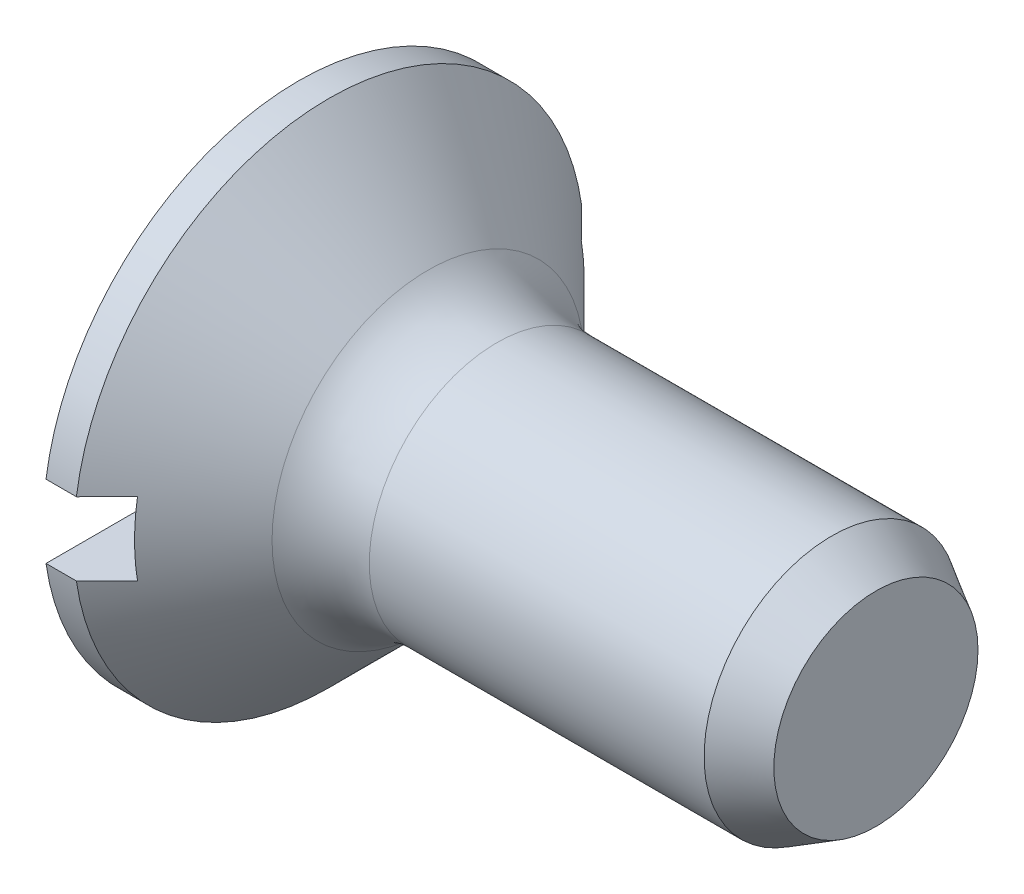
from build123d import *

# Parameters (mm, degrees)
CUT_EXTRUDE1_DEPTH      = 12.204017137
CUT_EXTRUDE1_DEPTH_BACK = 12.204017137
SKETCH2_W               = 1
SKETCH2_H               = 1.2
CHAMFER1_SIZE           = 0.42
CHAMFER1_SIZE2          = 0.727461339
FILLET1_R               = 1.6


with BuildPart() as part:
    # Sketch1 → Revolve1 (revolve)
    with BuildSketch(Plane.XY, mode=Mode.PRIVATE) as revolve1_sk:
        Polygon((0, 4.2), (0.5, 4.2), (2.6, 2.1), (9.5, 2.1), (9.5, 0), (0, 0), align=None)
    revolve(revolve1_sk.sketch.rotate(Axis((6.620684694, 0, 0), (-1, 0, 0)), 90), axis=Axis((6.620684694, 0, 0), (-1, 0, 0)))

    # Sketch2 → Cut-Extrude1 (cut, two sides: drawn at the far end of the back side and taken through both)
    with BuildSketch(Plane.XY.offset(-CUT_EXTRUDE1_DEPTH_BACK)):
        with Locations((0.5, 0)):
            Rectangle(SKETCH2_W, SKETCH2_H)
    extrude(amount=CUT_EXTRUDE1_DEPTH + CUT_EXTRUDE1_DEPTH_BACK, mode=Mode.SUBTRACT)

    # Chamfer1
    chamfer1_edges = [part.edges().sort_by_distance(p)[0] for p in [
        (9.5, 0, 2.1),
    ]]
    chamfer1_side = [part.faces().sort_by_distance(p)[0] for p in [
        (9.5, 0, 0),
    ]]
    chamfer(chamfer1_edges, length=CHAMFER1_SIZE, length2=CHAMFER1_SIZE2, reference=chamfer1_side[0])

    # Fillet1
    fillet1_edges = [part.edges().sort_by_distance(p)[0] for p in [
        (2.6, 0, 2.1),
    ]]
    fillet(fillet1_edges, radius=FILLET1_R)


solid = part.part
